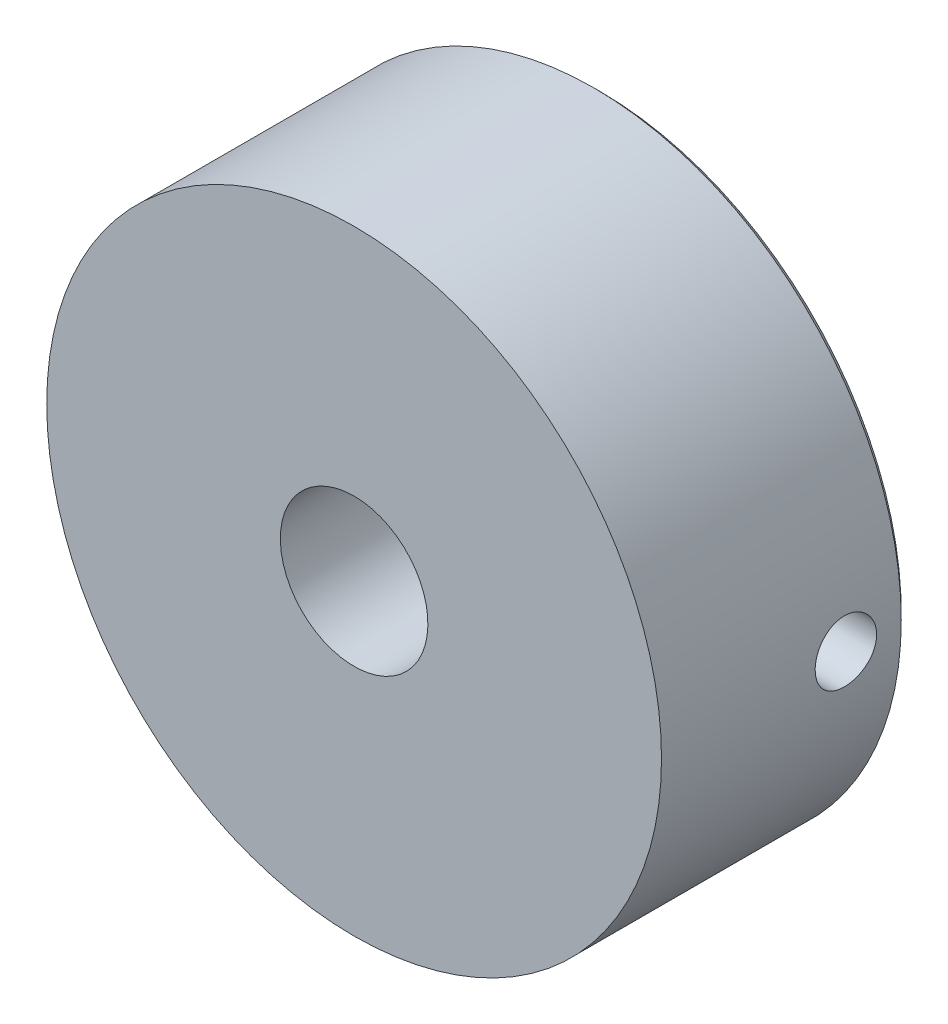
ISO-10303-21;
HEADER;
FILE_DESCRIPTION(('STEP AP214'),'2;1');
FILE_NAME('part.step','',(''),(''),'','','');
FILE_SCHEMA(('AUTOMOTIVE_DESIGN { 1 0 10303 214 1 1 1 1 }'));
ENDSEC;
DATA;
#1=APPLICATION_CONTEXT('core data for automotive mechanical design processes');
#2=APPLICATION_PROTOCOL_DEFINITION('international standard','automotive_design',2000,#1);
#3=PRODUCT_CONTEXT('',#1,'mechanical');
#4=PRODUCT('Part','Part','',(#3));
#5=PRODUCT_RELATED_PRODUCT_CATEGORY('part','',(#4));
#6=PRODUCT_DEFINITION_FORMATION('','',#4);
#7=PRODUCT_DEFINITION_CONTEXT('part definition',#1,'design');
#8=PRODUCT_DEFINITION('design','',#6,#7);
#9=PRODUCT_DEFINITION_SHAPE('','',#8);
#10=(LENGTH_UNIT() NAMED_UNIT(*) SI_UNIT(.MILLI.,.METRE.));
#11=(NAMED_UNIT(*) PLANE_ANGLE_UNIT() SI_UNIT($,.RADIAN.));
#12=(NAMED_UNIT(*) SI_UNIT($,.STERADIAN.) SOLID_ANGLE_UNIT());
#13=UNCERTAINTY_MEASURE_WITH_UNIT(LENGTH_MEASURE(1.E-05),#10,'distance_accuracy_value','');
#14=(GEOMETRIC_REPRESENTATION_CONTEXT(3) GLOBAL_UNCERTAINTY_ASSIGNED_CONTEXT((#13)) GLOBAL_UNIT_ASSIGNED_CONTEXT((#10,
#11,#12)) REPRESENTATION_CONTEXT('',''));
#15=CARTESIAN_POINT('',(0.,0.,0.));
#16=DIRECTION('',(0.,0.,1.));
#17=DIRECTION('',(1.,0.,0.));
#18=AXIS2_PLACEMENT_3D('',#15,#16,#17);
#19=CARTESIAN_POINT('',(0.,0.,20.));
#20=DIRECTION('',(0.,0.,1.));
#21=DIRECTION('',(0.,1.,0.));
#22=AXIS2_PLACEMENT_3D('',#19,#20,#21);
#23=PLANE('',#22);
#24=CARTESIAN_POINT('',(0.,0.,20.));
#25=DIRECTION('',(0.,0.,1.));
#26=DIRECTION('',(0.,1.,0.));
#27=AXIS2_PLACEMENT_3D('',#24,#25,#26);
#28=CIRCLE('',#27,25.);
#29=CARTESIAN_POINT('',(0.,25.,20.));
#30=VERTEX_POINT('',#29);
#31=EDGE_CURVE('E23',#30,#30,#28,.T.);
#32=ORIENTED_EDGE('',*,*,#31,.T.);
#33=EDGE_LOOP('',(#32));
#34=FACE_BOUND('',#33,.T.);
#35=CARTESIAN_POINT('',(0.,0.,20.));
#36=DIRECTION('',(0.,0.,1.));
#37=DIRECTION('',(0.,1.,0.));
#38=AXIS2_PLACEMENT_3D('',#35,#36,#37);
#39=CIRCLE('',#38,6.);
#40=CARTESIAN_POINT('',(0.,6.,20.));
#41=VERTEX_POINT('',#40);
#42=EDGE_CURVE('E27',#41,#41,#39,.T.);
#43=ORIENTED_EDGE('',*,*,#42,.F.);
#44=EDGE_LOOP('',(#43));
#45=FACE_BOUND('',#44,.T.);
#46=ADVANCED_FACE('F12',(#34,#45),#23,.T.);
#47=CARTESIAN_POINT('',(0.,0.,0.));
#48=DIRECTION('',(0.,0.,1.));
#49=DIRECTION('',(0.,1.,0.));
#50=AXIS2_PLACEMENT_3D('',#47,#48,#49);
#51=PLANE('',#50);
#52=CARTESIAN_POINT('',(0.,0.,0.));
#53=DIRECTION('',(0.,0.,1.));
#54=DIRECTION('',(0.,1.,0.));
#55=AXIS2_PLACEMENT_3D('',#52,#53,#54);
#56=CIRCLE('',#55,24.5);
#57=CARTESIAN_POINT('',(0.,24.5,0.));
#58=VERTEX_POINT('',#57);
#59=EDGE_CURVE('E8',#58,#58,#56,.F.);
#60=ORIENTED_EDGE('',*,*,#59,.T.);
#61=EDGE_LOOP('',(#60));
#62=FACE_BOUND('',#61,.T.);
#63=CARTESIAN_POINT('',(0.,0.,0.));
#64=DIRECTION('',(0.,0.,1.));
#65=DIRECTION('',(0.,1.,0.));
#66=AXIS2_PLACEMENT_3D('',#63,#64,#65);
#67=CIRCLE('',#66,6.);
#68=CARTESIAN_POINT('',(0.,6.,0.));
#69=VERTEX_POINT('',#68);
#70=EDGE_CURVE('E32',#69,#69,#67,.T.);
#71=ORIENTED_EDGE('',*,*,#70,.T.);
#72=EDGE_LOOP('',(#71));
#73=FACE_BOUND('',#72,.T.);
#74=ADVANCED_FACE('F64',(#62,#73),#51,.F.);
#75=CARTESIAN_POINT('',(0.,0.,20.));
#76=DIRECTION('',(0.,0.,-1.));
#77=DIRECTION('',(0.,-1.,0.));
#78=AXIS2_PLACEMENT_3D('',#75,#76,#77);
#79=CYLINDRICAL_SURFACE('',#78,25.);
#80=CARTESIAN_POINT('',(25.,0.,7.5));
#81=CARTESIAN_POINT('',(24.9999983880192,-0.140050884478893,7.49999393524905));
#82=CARTESIAN_POINT('',(24.9988106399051,-0.280194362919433,7.48819182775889));
#83=CARTESIAN_POINT('',(24.9941866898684,-0.556595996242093,7.44128907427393));
#84=CARTESIAN_POINT('',(24.9907480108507,-0.692849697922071,7.40616275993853));
#85=CARTESIAN_POINT('',(24.9820103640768,-0.957429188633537,7.31364439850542));
#86=CARTESIAN_POINT('',(24.9767125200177,-1.08575971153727,7.25626579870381));
#87=CARTESIAN_POINT('',(24.9648489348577,-1.33094040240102,7.12089773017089));
#88=CARTESIAN_POINT('',(24.9582834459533,-1.44779284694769,7.04291235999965));
#89=CARTESIAN_POINT('',(24.9445936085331,-1.66714887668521,6.86824325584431));
#90=CARTESIAN_POINT('',(24.9374675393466,-1.76960536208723,6.77150050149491));
#91=CARTESIAN_POINT('',(24.9234739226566,-1.95685630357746,6.56218866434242));
#92=CARTESIAN_POINT('',(24.9166063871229,-2.04164994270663,6.44961884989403));
#93=CARTESIAN_POINT('',(24.9038897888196,-2.19133492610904,6.21155367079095));
#94=CARTESIAN_POINT('',(24.8980429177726,-2.2561836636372,6.08603138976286));
#95=CARTESIAN_POINT('',(24.8880509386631,-2.3638659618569,5.82581103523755));
#96=CARTESIAN_POINT('',(24.8839057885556,-2.40670006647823,5.69111318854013));
#97=CARTESIAN_POINT('',(24.8778021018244,-2.46899760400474,5.41684549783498));
#98=CARTESIAN_POINT('',(24.8758362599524,-2.48853913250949,5.27729355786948));
#99=CARTESIAN_POINT('',(24.8742910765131,-2.5039382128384,4.99687784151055));
#100=CARTESIAN_POINT('',(24.8747116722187,-2.49979638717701,4.85601409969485));
#101=CARTESIAN_POINT('',(24.8778851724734,-2.4680107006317,4.5775117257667));
#102=CARTESIAN_POINT('',(24.8806296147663,-2.44045211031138,4.43986325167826));
#103=CARTESIAN_POINT('',(24.8881283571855,-2.36274786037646,4.17115509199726));
#104=CARTESIAN_POINT('',(24.8928826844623,-2.31260189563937,4.04009549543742));
#105=CARTESIAN_POINT('',(24.9038752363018,-2.19105223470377,3.78801603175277));
#106=CARTESIAN_POINT('',(24.9101160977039,-2.11961070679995,3.66701452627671));
#107=CARTESIAN_POINT('',(24.923376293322,-1.95752506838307,3.43868696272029));
#108=CARTESIAN_POINT('',(24.9303956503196,-1.86688039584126,3.33136130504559));
#109=CARTESIAN_POINT('',(24.9444596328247,-1.66848528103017,3.13293651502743));
#110=CARTESIAN_POINT('',(24.9515042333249,-1.56066119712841,3.04191099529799));
#111=CARTESIAN_POINT('',(24.964795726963,-1.33122370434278,2.87924091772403));
#112=CARTESIAN_POINT('',(24.9710426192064,-1.209610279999,2.80759638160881));
#113=CARTESIAN_POINT('',(24.9820368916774,-0.955995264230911,2.68572494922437));
#114=CARTESIAN_POINT('',(24.9867840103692,-0.823991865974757,2.63550178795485));
#115=CARTESIAN_POINT('',(24.9942411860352,-0.553368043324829,2.55795270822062));
#116=CARTESIAN_POINT('',(24.9969513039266,-0.4147478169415,2.53062610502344));
#117=CARTESIAN_POINT('',(25.0000212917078,-0.13546274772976,2.49973923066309));
#118=CARTESIAN_POINT('',(25.0003912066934,0.00519075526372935,2.49607737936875));
#119=CARTESIAN_POINT('',(24.9987660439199,0.285109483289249,2.51235715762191));
#120=CARTESIAN_POINT('',(24.9967709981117,0.424374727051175,2.5322984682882));
#121=CARTESIAN_POINT('',(24.9906465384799,0.697270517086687,2.59513423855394));
#122=CARTESIAN_POINT('',(24.986521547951,0.830912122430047,2.63798113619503));
#123=CARTESIAN_POINT('',(24.9765999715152,1.08911080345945,2.74536293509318));
#124=CARTESIAN_POINT('',(24.9708033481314,1.21366767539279,2.80989832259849));
#125=CARTESIAN_POINT('',(24.9581618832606,1.45062045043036,2.95907709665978));
#126=CARTESIAN_POINT('',(24.951313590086,1.56297414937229,3.04378722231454));
#127=CARTESIAN_POINT('',(24.937348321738,1.7719040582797,3.23081516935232));
#128=CARTESIAN_POINT('',(24.9302313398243,1.86847987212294,3.33313343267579));
#129=CARTESIAN_POINT('',(24.9165006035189,2.04346527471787,3.5529164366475));
#130=CARTESIAN_POINT('',(24.9098887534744,2.12180819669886,3.67043439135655));
#131=CARTESIAN_POINT('',(24.8979458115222,2.25764564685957,3.91701840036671));
#132=CARTESIAN_POINT('',(24.892614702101,2.3151404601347,4.04608429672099));
#133=CARTESIAN_POINT('',(24.8838486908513,2.40753802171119,4.31187184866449));
#134=CARTESIAN_POINT('',(24.8804104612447,2.44248043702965,4.4485796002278));
#135=CARTESIAN_POINT('',(24.8758091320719,2.48891001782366,4.72595799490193));
#136=CARTESIAN_POINT('',(24.8746459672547,2.5003978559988,4.86662852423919));
#137=CARTESIAN_POINT('',(24.8747278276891,2.49958284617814,5.14727672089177));
#138=CARTESIAN_POINT('',(24.8759622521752,2.48738472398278,5.28725470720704));
#139=CARTESIAN_POINT('',(24.8806775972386,2.43976363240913,5.56316229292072));
#140=CARTESIAN_POINT('',(24.884158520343,2.4043406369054,5.69909188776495));
#141=CARTESIAN_POINT('',(24.8929717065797,2.31130421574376,5.96304337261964));
#142=CARTESIAN_POINT('',(24.898303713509,2.25369386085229,6.09106635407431));
#143=CARTESIAN_POINT('',(24.910218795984,2.11792888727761,6.33564222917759));
#144=CARTESIAN_POINT('',(24.9168018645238,2.03977438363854,6.45219518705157));
#145=CARTESIAN_POINT('',(24.9305121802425,1.86474639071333,6.67105918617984));
#146=CARTESIAN_POINT('',(24.9376416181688,1.76779487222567,6.77330769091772));
#147=CARTESIAN_POINT('',(24.9516213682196,1.55807924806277,6.96013058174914));
#148=CARTESIAN_POINT('',(24.9584716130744,1.44531136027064,7.04470072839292));
#149=CARTESIAN_POINT('',(24.9711390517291,1.20685358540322,7.19393363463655));
#150=CARTESIAN_POINT('',(24.9769536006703,1.08113187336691,7.25854572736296));
#151=CARTESIAN_POINT('',(24.9868657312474,0.820645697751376,7.36565605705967));
#152=CARTESIAN_POINT('',(24.9909652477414,0.685891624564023,7.40817922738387));
#153=CARTESIAN_POINT('',(24.9959553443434,0.458645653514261,7.459301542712));
#154=CARTESIAN_POINT('',(24.9974650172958,0.367606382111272,7.47454261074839));
#155=CARTESIAN_POINT('',(24.9994878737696,0.184391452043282,7.4948938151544));
#156=CARTESIAN_POINT('',(25.0000010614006,0.0922157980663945,7.50000399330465));
#157=CARTESIAN_POINT('',(25.,0.,7.5));
#158=B_SPLINE_CURVE_WITH_KNOTS('',3,(#80,#81,#82,#83,#84,#85,#86,#87,#88,#89,#90,#91,#92,#93,
#94,#95,#96,#97,#98,#99,#100,#101,#102,#103,#104,#105,#106,#107,#108,#109,#110,#111,#112,#113,
#114,#115,#116,#117,#118,#119,#120,#121,#122,#123,#124,#125,#126,#127,#128,#129,#130,#131,#132,
#133,#134,#135,#136,#137,#138,#139,#140,#141,#142,#143,#144,#145,#146,#147,#148,#149,#150,#151,
#152,#153,#154,#155,#156,#157),.UNSPECIFIED.,.T.,.F.,(4,2,2,2,2,2,2,2,2,2,2,2,2,2,2,2,2,2,2,2,2,
2,2,2,2,2,2,2,2,2,2,2,2,2,2,2,2,2,4),(0.,0.419815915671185,0.840094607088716,1.26011971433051,
1.68006134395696,2.10134642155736,2.52265098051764,2.94484938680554,3.3670373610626,
3.78780580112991,4.20856318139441,4.62779493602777,5.04703235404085,5.46701903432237,
5.88701800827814,6.30886835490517,6.73071917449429,7.15264351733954,7.57455524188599,
7.99465471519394,8.41474851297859,8.83397338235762,9.25320765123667,9.67384851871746,
10.0944999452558,10.516666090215,10.9388264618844,11.3602422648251,11.7816459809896,
12.2011907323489,12.620735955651,13.04022313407,13.459707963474,13.8809729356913,
14.3023388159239,14.7247657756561,15.1467148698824,15.4231416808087,15.6995673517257),.UNSPECIFIED.);
#159=CARTESIAN_POINT('',(25.,0.,7.5));
#160=VERTEX_POINT('',#159);
#161=EDGE_CURVE('E35',#160,#160,#158,.T.);
#162=ORIENTED_EDGE('',*,*,#161,.F.);
#163=EDGE_LOOP('',(#162));
#164=FACE_BOUND('',#163,.T.);
#165=CARTESIAN_POINT('',(0.,0.,0.5));
#166=DIRECTION('',(0.,0.,1.));
#167=DIRECTION('',(0.,1.,0.));
#168=AXIS2_PLACEMENT_3D('',#165,#166,#167);
#169=CIRCLE('',#168,25.);
#170=CARTESIAN_POINT('',(0.,25.,0.5));
#171=VERTEX_POINT('',#170);
#172=EDGE_CURVE('E19',#171,#171,#169,.T.);
#173=ORIENTED_EDGE('',*,*,#172,.T.);
#174=EDGE_LOOP('',(#173));
#175=FACE_BOUND('',#174,.T.);
#176=ORIENTED_EDGE('',*,*,#31,.F.);
#177=EDGE_LOOP('',(#176));
#178=FACE_BOUND('',#177,.T.);
#179=ADVANCED_FACE('F14',(#164,#175,#178),#79,.T.);
#180=CARTESIAN_POINT('',(0.,0.,20.));
#181=DIRECTION('',(0.,0.,-1.));
#182=DIRECTION('',(0.,-1.,0.));
#183=AXIS2_PLACEMENT_3D('',#180,#181,#182);
#184=CYLINDRICAL_SURFACE('',#183,6.);
#185=CARTESIAN_POINT('',(6.,0.,7.5));
#186=CARTESIAN_POINT('',(5.99999628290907,-0.133903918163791,7.4999952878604));
#187=CARTESIAN_POINT('',(5.99546656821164,-0.268039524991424,7.48917868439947));
#188=CARTESIAN_POINT('',(5.97780115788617,-0.532498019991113,7.44631926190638));
#189=CARTESIAN_POINT('',(5.96464300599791,-0.66281002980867,7.41422105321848));
#190=CARTESIAN_POINT('',(5.93112629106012,-0.915376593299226,7.3301785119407));
#191=CARTESIAN_POINT('',(5.91079213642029,-1.03765681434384,7.27830140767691));
#192=CARTESIAN_POINT('',(5.8649055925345,-1.27165974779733,7.15645416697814));
#193=CARTESIAN_POINT('',(5.83935478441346,-1.38338564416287,7.08648951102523));
#194=CARTESIAN_POINT('',(5.78415660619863,-1.59889674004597,6.92674208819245));
#195=CARTESIAN_POINT('',(5.75437507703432,-1.70208251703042,6.83619739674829));
#196=CARTESIAN_POINT('',(5.69465427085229,-1.8923196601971,6.63947131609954));
#197=CARTESIAN_POINT('',(5.66471491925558,-1.9793625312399,6.53328174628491));
#198=CARTESIAN_POINT('',(5.60642043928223,-2.13907474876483,6.30194644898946));
#199=CARTESIAN_POINT('',(5.57821573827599,-2.2108261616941,6.17612510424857));
#200=CARTESIAN_POINT('',(5.52871144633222,-2.331878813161,5.91285348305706));
#201=CARTESIAN_POINT('',(5.50740829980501,-2.38119161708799,5.7754092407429));
#202=CARTESIAN_POINT('',(5.47557110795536,-2.45349196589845,5.49969261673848));
#203=CARTESIAN_POINT('',(5.46456775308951,-2.47763315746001,5.36177903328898));
#204=CARTESIAN_POINT('',(5.45322652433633,-2.50250419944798,5.08345341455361));
#205=CARTESIAN_POINT('',(5.45288276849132,-2.5032469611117,4.94304279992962));
#206=CARTESIAN_POINT('',(5.46250239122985,-2.48216900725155,4.67519987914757));
#207=CARTESIAN_POINT('',(5.47167765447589,-2.46207362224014,4.54759780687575));
#208=CARTESIAN_POINT('',(5.49796965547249,-2.40278382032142,4.29777581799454));
#209=CARTESIAN_POINT('',(5.51508791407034,-2.36358574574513,4.17555693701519));
#210=CARTESIAN_POINT('',(5.55572369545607,-2.2664391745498,3.93688459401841));
#211=CARTESIAN_POINT('',(5.57936963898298,-2.20810943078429,3.82060915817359));
#212=CARTESIAN_POINT('',(5.63036662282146,-2.07462485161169,3.59904453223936));
#213=CARTESIAN_POINT('',(5.65771912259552,-1.99946338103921,3.49375969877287));
#214=CARTESIAN_POINT('',(5.71585953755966,-1.82699193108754,3.28780008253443));
#215=CARTESIAN_POINT('',(5.74674242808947,-1.72834696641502,3.18826686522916));
#216=CARTESIAN_POINT('',(5.80651346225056,-1.51545918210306,3.00677299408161));
#217=CARTESIAN_POINT('',(5.83540113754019,-1.40121271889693,2.92481645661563));
#218=CARTESIAN_POINT('',(5.88876567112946,-1.15689589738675,2.77912835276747));
#219=CARTESIAN_POINT('',(5.91312533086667,-1.02652116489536,2.71586110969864));
#220=CARTESIAN_POINT('',(5.95378962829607,-0.755704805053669,2.61255772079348));
#221=CARTESIAN_POINT('',(5.970098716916,-0.615268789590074,2.57250873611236));
#222=CARTESIAN_POINT('',(5.9919928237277,-0.337856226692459,2.51916801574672));
#223=CARTESIAN_POINT('',(5.9981908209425,-0.201222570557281,2.5043442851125));
#224=CARTESIAN_POINT('',(6.00112100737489,0.0727093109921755,2.49730755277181));
#225=CARTESIAN_POINT('',(5.99785591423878,0.210007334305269,2.505088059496));
#226=CARTESIAN_POINT('',(5.9826243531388,0.474196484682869,2.54194216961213));
#227=CARTESIAN_POINT('',(5.97109774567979,0.601265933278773,2.56993990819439));
#228=CARTESIAN_POINT('',(5.94097213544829,0.848765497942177,2.64493638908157));
#229=CARTESIAN_POINT('',(5.92237223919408,0.969194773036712,2.69193753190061));
#230=CARTESIAN_POINT('',(5.87916541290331,1.20421799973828,2.80514195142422));
#231=CARTESIAN_POINT('',(5.85438982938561,1.31851447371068,2.87189636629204));
#232=CARTESIAN_POINT('',(5.80147609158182,1.53469243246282,3.02210675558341));
#233=CARTESIAN_POINT('',(5.77333653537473,1.63656870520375,3.10556970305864));
#234=CARTESIAN_POINT('',(5.71424175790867,1.83266686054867,3.2938064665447));
#235=CARTESIAN_POINT('',(5.68322903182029,1.92582139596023,3.3996770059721));
#236=CARTESIAN_POINT('',(5.6236867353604,2.09333969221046,3.6260425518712));
#237=CARTESIAN_POINT('',(5.59515772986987,2.16769918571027,3.74654087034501));
#238=CARTESIAN_POINT('',(5.54362772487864,2.29631920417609,4.00122835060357));
#239=CARTESIAN_POINT('',(5.52071125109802,2.35027836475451,4.13558807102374));
#240=CARTESIAN_POINT('',(5.48416711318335,2.43434827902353,4.41274118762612));
#241=CARTESIAN_POINT('',(5.47053179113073,2.46447869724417,4.55552752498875));
#242=CARTESIAN_POINT('',(5.4552632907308,2.49808160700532,4.83363739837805));
#243=CARTESIAN_POINT('',(5.45278701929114,2.50342760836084,4.96868932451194));
#244=CARTESIAN_POINT('',(5.45787706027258,2.49231151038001,5.23768572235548));
#245=CARTESIAN_POINT('',(5.46544183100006,2.47585275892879,5.3716303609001));
#246=CARTESIAN_POINT('',(5.48899102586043,2.42316809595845,5.62818549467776));
#247=CARTESIAN_POINT('',(5.50456709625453,2.38789807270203,5.75103334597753));
#248=CARTESIAN_POINT('',(5.54206362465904,2.29952656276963,5.98909604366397));
#249=CARTESIAN_POINT('',(5.56398586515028,2.24642006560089,6.10430873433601));
#250=CARTESIAN_POINT('',(5.61333908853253,2.1202057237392,6.33139178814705));
#251=CARTESIAN_POINT('',(5.64102204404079,2.04608723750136,6.44264464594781));
#252=CARTESIAN_POINT('',(5.69807379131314,1.88136812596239,6.65172029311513));
#253=CARTESIAN_POINT('',(5.72744316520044,1.79076178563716,6.74953840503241));
#254=CARTESIAN_POINT('',(5.78712781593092,1.58780416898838,6.93629730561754));
#255=CARTESIAN_POINT('',(5.8173561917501,1.47434977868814,7.0240726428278));
#256=CARTESIAN_POINT('',(5.87320303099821,1.23319985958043,7.17939913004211));
#257=CARTESIAN_POINT('',(5.89881939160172,1.1054978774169,7.24694106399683));
#258=CARTESIAN_POINT('',(5.94218308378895,0.841465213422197,7.35841887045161));
#259=CARTESIAN_POINT('',(5.96005349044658,0.705312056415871,7.40272649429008));
#260=CARTESIAN_POINT('',(5.9864223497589,0.426816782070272,7.46741568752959));
#261=CARTESIAN_POINT('',(5.99495014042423,0.284495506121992,7.4878721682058));
#262=CARTESIAN_POINT('',(5.99888566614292,0.118052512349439,7.49732384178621));
#263=CARTESIAN_POINT('',(5.99930292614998,0.0944569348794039,7.49832660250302));
#264=CARTESIAN_POINT('',(5.99986042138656,0.0472433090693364,7.49966509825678));
#265=CARTESIAN_POINT('',(6.0000006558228,0.0236252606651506,7.50000083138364));
#266=CARTESIAN_POINT('',(6.,0.,7.5));
#267=B_SPLINE_CURVE_WITH_KNOTS('',3,(#185,#186,#187,#188,#189,#190,#191,#192,#193,#194,#195,
#196,#197,#198,#199,#200,#201,#202,#203,#204,#205,#206,#207,#208,#209,#210,#211,#212,#213,#214,
#215,#216,#217,#218,#219,#220,#221,#222,#223,#224,#225,#226,#227,#228,#229,#230,#231,#232,#233,
#234,#235,#236,#237,#238,#239,#240,#241,#242,#243,#244,#245,#246,#247,#248,#249,#250,#251,#252,
#253,#254,#255,#256,#257,#258,#259,#260,#261,#262,#263,#264,#265,#266),.UNSPECIFIED.,.T.,.F.,(4,
2,2,2,2,2,2,2,2,2,2,2,2,2,2,2,2,2,2,2,2,2,2,2,2,2,2,2,2,2,2,2,2,2,2,2,2,2,2,2,4),(0.,
0.401613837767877,0.804277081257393,1.2055837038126,1.60676887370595,2.02635872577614,
2.44616876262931,2.88663449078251,3.32687293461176,3.74590546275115,4.16470676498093,
4.55140314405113,4.93817359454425,5.33317426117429,5.72833091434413,6.15688282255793,
6.58553498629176,7.02408110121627,7.46238448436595,7.87296886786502,8.28343534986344,
8.67353179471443,9.06367753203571,9.46594270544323,9.86837610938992,10.2995697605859,
10.7308612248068,11.1682957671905,11.6053689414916,12.0087975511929,12.4121642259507,
12.7967529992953,13.1814498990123,13.5892778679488,13.9972474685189,14.4349307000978,
14.8728129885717,15.3034571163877,15.7327450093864,15.8036033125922,15.8744618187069),.UNSPECIFIED.);
#268=CARTESIAN_POINT('',(6.,0.,7.5));
#269=VERTEX_POINT('',#268);
#270=EDGE_CURVE('E43',#269,#269,#267,.T.);
#271=ORIENTED_EDGE('',*,*,#270,.T.);
#272=EDGE_LOOP('',(#271));
#273=FACE_BOUND('',#272,.T.);
#274=ORIENTED_EDGE('',*,*,#42,.T.);
#275=EDGE_LOOP('',(#274));
#276=FACE_BOUND('',#275,.T.);
#277=ORIENTED_EDGE('',*,*,#70,.F.);
#278=EDGE_LOOP('',(#277));
#279=FACE_BOUND('',#278,.T.);
#280=ADVANCED_FACE('F59',(#273,#276,#279),#184,.F.);
#281=CARTESIAN_POINT('',(0.,0.,0.5));
#282=DIRECTION('',(0.,0.,1.));
#283=DIRECTION('',(0.,1.,0.));
#284=AXIS2_PLACEMENT_3D('',#281,#282,#283);
#285=CONICAL_SURFACE('',#284,25.,0.785398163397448);
#286=ORIENTED_EDGE('',*,*,#59,.F.);
#287=EDGE_LOOP('',(#286));
#288=FACE_BOUND('',#287,.T.);
#289=ORIENTED_EDGE('',*,*,#172,.F.);
#290=EDGE_LOOP('',(#289));
#291=FACE_BOUND('',#290,.T.);
#292=ADVANCED_FACE('F54',(#288,#291),#285,.T.);
#293=CARTESIAN_POINT('',(25.001,0.,5.));
#294=DIRECTION('',(-1.,0.,0.));
#295=DIRECTION('',(0.,0.,1.));
#296=AXIS2_PLACEMENT_3D('',#293,#294,#295);
#297=CYLINDRICAL_SURFACE('',#296,2.5);
#298=ORIENTED_EDGE('',*,*,#270,.F.);
#299=EDGE_LOOP('',(#298));
#300=FACE_BOUND('',#299,.T.);
#301=ORIENTED_EDGE('',*,*,#161,.T.);
#302=EDGE_LOOP('',(#301));
#303=FACE_BOUND('',#302,.T.);
#304=ADVANCED_FACE('F48',(#300,#303),#297,.F.);
#305=CLOSED_SHELL('',(#46,#74,#179,#280,#292,#304));
#306=MANIFOLD_SOLID_BREP('B1',#305);
#307=ADVANCED_BREP_SHAPE_REPRESENTATION('',(#18,#306),#14);
#308=SHAPE_DEFINITION_REPRESENTATION(#9,#307);
ENDSEC;
END-ISO-10303-21;
